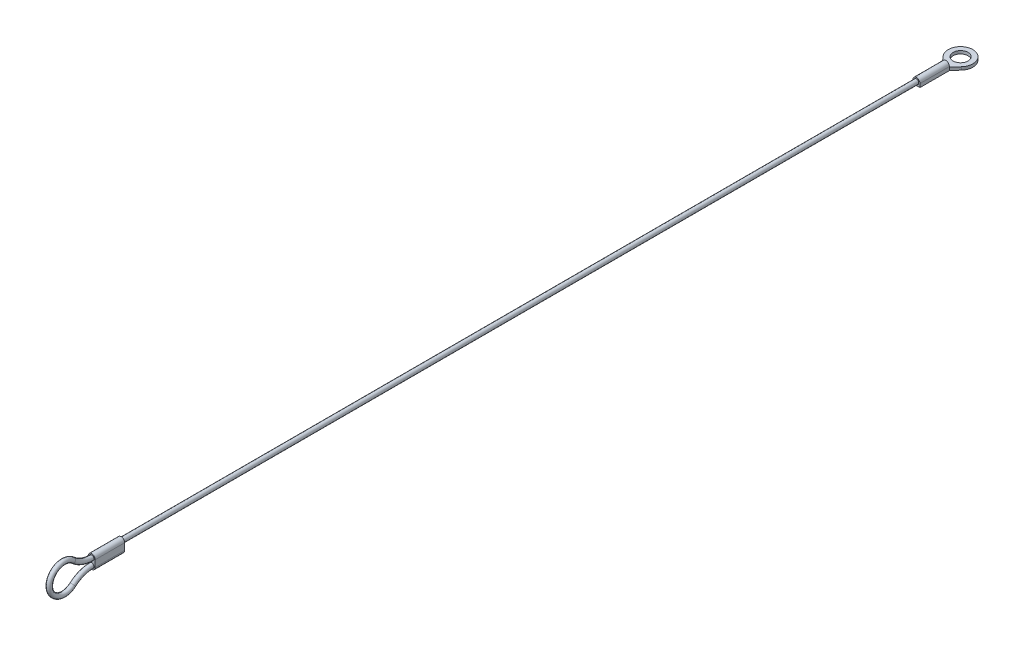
ISO-10303-21;
HEADER;
FILE_DESCRIPTION(('STEP AP214'),'2;1');
FILE_NAME('part.step','',(''),(''),'','','');
FILE_SCHEMA(('AUTOMOTIVE_DESIGN { 1 0 10303 214 1 1 1 1 }'));
ENDSEC;
DATA;
#1=APPLICATION_CONTEXT('core data for automotive mechanical design processes');
#2=APPLICATION_PROTOCOL_DEFINITION('international standard','automotive_design',2000,#1);
#3=PRODUCT_CONTEXT('',#1,'mechanical');
#4=PRODUCT('Part','Part','',(#3));
#5=PRODUCT_RELATED_PRODUCT_CATEGORY('part','',(#4));
#6=PRODUCT_DEFINITION_FORMATION('','',#4);
#7=PRODUCT_DEFINITION_CONTEXT('part definition',#1,'design');
#8=PRODUCT_DEFINITION('design','',#6,#7);
#9=PRODUCT_DEFINITION_SHAPE('','',#8);
#10=(LENGTH_UNIT() NAMED_UNIT(*) SI_UNIT(.MILLI.,.METRE.));
#11=(NAMED_UNIT(*) PLANE_ANGLE_UNIT() SI_UNIT($,.RADIAN.));
#12=(NAMED_UNIT(*) SI_UNIT($,.STERADIAN.) SOLID_ANGLE_UNIT());
#13=UNCERTAINTY_MEASURE_WITH_UNIT(LENGTH_MEASURE(1.E-05),#10,'distance_accuracy_value','');
#14=(GEOMETRIC_REPRESENTATION_CONTEXT(3) GLOBAL_UNCERTAINTY_ASSIGNED_CONTEXT((#13)) GLOBAL_UNIT_ASSIGNED_CONTEXT((#10,
#11,#12)) REPRESENTATION_CONTEXT('',''));
#15=CARTESIAN_POINT('',(0.,0.,0.));
#16=DIRECTION('',(0.,0.,1.));
#17=DIRECTION('',(1.,0.,0.));
#18=AXIS2_PLACEMENT_3D('',#15,#16,#17);
#19=CARTESIAN_POINT('',(0.,0.,-10.));
#20=DIRECTION('',(0.,0.,-1.));
#21=DIRECTION('',(-1.,0.,0.));
#22=AXIS2_PLACEMENT_3D('',#19,#20,#21);
#23=PLANE('',#22);
#24=DIRECTION('',(0.,-1.,0.));
#25=VECTOR('',#24,1.);
#26=CARTESIAN_POINT('',(1.195,0.,-10.));
#27=LINE('',#26,#25);
#28=CARTESIAN_POINT('',(1.195,0.,-10.));
#29=VERTEX_POINT('',#28);
#30=CARTESIAN_POINT('',(1.195,-0.185,-10.));
#31=VERTEX_POINT('',#30);
#32=EDGE_CURVE('E169',#29,#31,#27,.T.);
#33=ORIENTED_EDGE('',*,*,#32,.T.);
#34=DIRECTION('',(-1.,0.,0.));
#35=VECTOR('',#34,1.);
#36=CARTESIAN_POINT('',(-1.195,-0.185,-10.));
#37=LINE('',#36,#35);
#38=CARTESIAN_POINT('',(-1.195,-0.185,-10.));
#39=VERTEX_POINT('',#38);
#40=EDGE_CURVE('E138',#31,#39,#37,.T.);
#41=ORIENTED_EDGE('',*,*,#40,.T.);
#42=DIRECTION('',(0.,1.,0.));
#43=VECTOR('',#42,1.);
#44=CARTESIAN_POINT('',(-1.195,-1.195,-10.));
#45=LINE('',#44,#43);
#46=CARTESIAN_POINT('',(-1.195,0.,-10.));
#47=VERTEX_POINT('',#46);
#48=EDGE_CURVE('E173',#39,#47,#45,.T.);
#49=ORIENTED_EDGE('',*,*,#48,.T.);
#50=CARTESIAN_POINT('',(0.,0.,-10.));
#51=DIRECTION('',(0.,0.,-1.));
#52=DIRECTION('',(-1.,0.,0.));
#53=AXIS2_PLACEMENT_3D('',#50,#51,#52);
#54=CIRCLE('',#53,1.195);
#55=EDGE_CURVE('E166',#47,#29,#54,.T.);
#56=ORIENTED_EDGE('',*,*,#55,.T.);
#57=EDGE_LOOP('',(#33,#41,#49,#56));
#58=FACE_BOUND('',#57,.T.);
#59=ADVANCED_FACE('F33',(#58),#23,.T.);
#60=CARTESIAN_POINT('',(0.,0.,280.2));
#61=DIRECTION('',(0.,0.,-1.));
#62=DIRECTION('',(-1.,0.,0.));
#63=AXIS2_PLACEMENT_3D('',#60,#61,#62);
#64=CYLINDRICAL_SURFACE('',#63,0.795);
#65=CARTESIAN_POINT('',(0.,0.,270.2));
#66=DIRECTION('',(0.,0.,-1.));
#67=DIRECTION('',(0.,1.,0.));
#68=AXIS2_PLACEMENT_3D('',#65,#66,#67);
#69=CIRCLE('',#68,0.795);
#70=CARTESIAN_POINT('',(0.,0.795,270.2));
#71=VERTEX_POINT('',#70);
#72=EDGE_CURVE('E37',#71,#71,#69,.T.);
#73=ORIENTED_EDGE('',*,*,#72,.T.);
#74=EDGE_LOOP('',(#73));
#75=FACE_BOUND('',#74,.T.);
#76=CARTESIAN_POINT('',(0.,0.,0.));
#77=DIRECTION('',(0.,0.,1.));
#78=DIRECTION('',(1.,0.,0.));
#79=AXIS2_PLACEMENT_3D('',#76,#77,#78);
#80=CIRCLE('',#79,0.795);
#81=CARTESIAN_POINT('',(0.795,0.,0.));
#82=VERTEX_POINT('',#81);
#83=EDGE_CURVE('E195',#82,#82,#80,.T.);
#84=ORIENTED_EDGE('',*,*,#83,.T.);
#85=EDGE_LOOP('',(#84));
#86=FACE_BOUND('',#85,.T.);
#87=ADVANCED_FACE('F35',(#75,#86),#64,.T.);
#88=CARTESIAN_POINT('',(0.,3.90601902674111E-13,270.2));
#89=DIRECTION('',(0.,0.,1.));
#90=DIRECTION('',(0.,-1.,0.));
#91=AXIS2_PLACEMENT_3D('',#88,#89,#90);
#92=CYLINDRICAL_SURFACE('',#91,1.195);
#93=CARTESIAN_POINT('',(0.,4.05057931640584E-13,280.2));
#94=DIRECTION('',(0.,0.,-1.));
#95=DIRECTION('',(0.,1.,0.));
#96=AXIS2_PLACEMENT_3D('',#93,#94,#95);
#97=CIRCLE('',#96,1.195);
#98=CARTESIAN_POINT('',(-1.195,4.05204276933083E-13,280.2));
#99=VERTEX_POINT('',#98);
#100=CARTESIAN_POINT('',(1.195,4.04911586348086E-13,280.2));
#101=VERTEX_POINT('',#100);
#102=EDGE_CURVE('E203',#99,#101,#97,.T.);
#103=ORIENTED_EDGE('',*,*,#102,.T.);
#104=DIRECTION('',(0.,0.,1.));
#105=VECTOR('',#104,1.);
#106=CARTESIAN_POINT('',(1.195,3.90455557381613E-13,270.2));
#107=LINE('',#106,#105);
#108=CARTESIAN_POINT('',(1.195,3.90455557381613E-13,270.2));
#109=VERTEX_POINT('',#108);
#110=EDGE_CURVE('E217',#109,#101,#107,.T.);
#111=ORIENTED_EDGE('',*,*,#110,.F.);
#112=CARTESIAN_POINT('',(0.,3.90601902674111E-13,270.2));
#113=DIRECTION('',(0.,0.,-1.));
#114=DIRECTION('',(0.,1.,0.));
#115=AXIS2_PLACEMENT_3D('',#112,#113,#114);
#116=CIRCLE('',#115,1.195);
#117=CARTESIAN_POINT('',(-1.195,3.90748247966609E-13,270.2));
#118=VERTEX_POINT('',#117);
#119=EDGE_CURVE('E196',#118,#109,#116,.T.);
#120=ORIENTED_EDGE('',*,*,#119,.F.);
#121=DIRECTION('',(0.,0.,1.));
#122=VECTOR('',#121,1.);
#123=CARTESIAN_POINT('',(-1.195,3.90748247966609E-13,270.2));
#124=LINE('',#123,#122);
#125=EDGE_CURVE('E202',#118,#99,#124,.T.);
#126=ORIENTED_EDGE('',*,*,#125,.T.);
#127=EDGE_LOOP('',(#103,#111,#120,#126));
#128=FACE_BOUND('',#127,.T.);
#129=ADVANCED_FACE('F258',(#128),#92,.T.);
#130=CARTESIAN_POINT('',(1.195,3.90455557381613E-13,270.2));
#131=DIRECTION('',(-1.,0.,0.));
#132=DIRECTION('',(0.,-1.,0.));
#133=AXIS2_PLACEMENT_3D('',#130,#131,#132);
#134=PLANE('',#133);
#135=DIRECTION('',(0.,-1.,0.));
#136=VECTOR('',#135,1.);
#137=CARTESIAN_POINT('',(1.195,4.04911586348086E-13,280.2));
#138=LINE('',#137,#136);
#139=CARTESIAN_POINT('',(1.195,-2.26625258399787,280.2));
#140=VERTEX_POINT('',#139);
#141=EDGE_CURVE('E206',#101,#140,#138,.T.);
#142=ORIENTED_EDGE('',*,*,#141,.T.);
#143=DIRECTION('',(0.,0.,1.));
#144=VECTOR('',#143,1.);
#145=CARTESIAN_POINT('',(1.195,-2.26625258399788,270.2));
#146=LINE('',#145,#144);
#147=CARTESIAN_POINT('',(1.195,-2.26625258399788,270.2));
#148=VERTEX_POINT('',#147);
#149=EDGE_CURVE('E214',#148,#140,#146,.T.);
#150=ORIENTED_EDGE('',*,*,#149,.F.);
#151=DIRECTION('',(0.,-1.,0.));
#152=VECTOR('',#151,1.);
#153=CARTESIAN_POINT('',(1.195,3.90455557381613E-13,270.2));
#154=LINE('',#153,#152);
#155=EDGE_CURVE('E88',#109,#148,#154,.T.);
#156=ORIENTED_EDGE('',*,*,#155,.F.);
#157=ORIENTED_EDGE('',*,*,#110,.T.);
#158=EDGE_LOOP('',(#142,#150,#156,#157));
#159=FACE_BOUND('',#158,.T.);
#160=ADVANCED_FACE('F287',(#159),#134,.F.);
#161=CARTESIAN_POINT('',(0.,-2.26625258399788,270.2));
#162=DIRECTION('',(0.,0.,1.));
#163=DIRECTION('',(0.,-1.,0.));
#164=AXIS2_PLACEMENT_3D('',#161,#162,#163);
#165=CYLINDRICAL_SURFACE('',#164,1.195);
#166=CARTESIAN_POINT('',(0.,-2.26625258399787,280.2));
#167=DIRECTION('',(0.,0.,-1.));
#168=DIRECTION('',(0.,1.,0.));
#169=AXIS2_PLACEMENT_3D('',#166,#167,#168);
#170=CIRCLE('',#169,1.195);
#171=CARTESIAN_POINT('',(-1.195,-2.26625258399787,280.2));
#172=VERTEX_POINT('',#171);
#173=EDGE_CURVE('E208',#140,#172,#170,.T.);
#174=ORIENTED_EDGE('',*,*,#173,.T.);
#175=DIRECTION('',(0.,0.,1.));
#176=VECTOR('',#175,1.);
#177=CARTESIAN_POINT('',(-1.195,-2.26625258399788,270.2));
#178=LINE('',#177,#176);
#179=CARTESIAN_POINT('',(-1.195,-2.26625258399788,270.2));
#180=VERTEX_POINT('',#179);
#181=EDGE_CURVE('E212',#180,#172,#178,.T.);
#182=ORIENTED_EDGE('',*,*,#181,.F.);
#183=CARTESIAN_POINT('',(0.,-2.26625258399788,270.2));
#184=DIRECTION('',(0.,0.,-1.));
#185=DIRECTION('',(0.,1.,0.));
#186=AXIS2_PLACEMENT_3D('',#183,#184,#185);
#187=CIRCLE('',#186,1.195);
#188=EDGE_CURVE('E199',#148,#180,#187,.T.);
#189=ORIENTED_EDGE('',*,*,#188,.F.);
#190=ORIENTED_EDGE('',*,*,#149,.T.);
#191=EDGE_LOOP('',(#174,#182,#189,#190));
#192=FACE_BOUND('',#191,.T.);
#193=ADVANCED_FACE('F284',(#192),#165,.T.);
#194=CARTESIAN_POINT('',(-1.195,3.90748247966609E-13,270.2));
#195=DIRECTION('',(1.,0.,0.));
#196=DIRECTION('',(0.,0.,-1.));
#197=AXIS2_PLACEMENT_3D('',#194,#195,#196);
#198=PLANE('',#197);
#199=DIRECTION('',(0.,1.,0.));
#200=VECTOR('',#199,1.);
#201=CARTESIAN_POINT('',(-1.195,4.05204276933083E-13,280.2));
#202=LINE('',#201,#200);
#203=EDGE_CURVE('E80',#172,#99,#202,.T.);
#204=ORIENTED_EDGE('',*,*,#203,.T.);
#205=ORIENTED_EDGE('',*,*,#125,.F.);
#206=DIRECTION('',(0.,1.,0.));
#207=VECTOR('',#206,1.);
#208=CARTESIAN_POINT('',(-1.195,3.90748247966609E-13,270.2));
#209=LINE('',#208,#207);
#210=EDGE_CURVE('E59',#180,#118,#209,.T.);
#211=ORIENTED_EDGE('',*,*,#210,.F.);
#212=ORIENTED_EDGE('',*,*,#181,.T.);
#213=EDGE_LOOP('',(#204,#205,#211,#212));
#214=FACE_BOUND('',#213,.T.);
#215=ADVANCED_FACE('F276',(#214),#198,.F.);
#216=CARTESIAN_POINT('',(0.,3.90601902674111E-13,270.2));
#217=DIRECTION('',(0.,0.,-1.));
#218=DIRECTION('',(0.,1.,0.));
#219=AXIS2_PLACEMENT_3D('',#216,#217,#218);
#220=PLANE('',#219);
#221=ORIENTED_EDGE('',*,*,#72,.F.);
#222=EDGE_LOOP('',(#221));
#223=FACE_BOUND('',#222,.T.);
#224=ORIENTED_EDGE('',*,*,#119,.T.);
#225=ORIENTED_EDGE('',*,*,#155,.T.);
#226=ORIENTED_EDGE('',*,*,#188,.T.);
#227=ORIENTED_EDGE('',*,*,#210,.T.);
#228=EDGE_LOOP('',(#224,#225,#226,#227));
#229=FACE_BOUND('',#228,.T.);
#230=ADVANCED_FACE('F272',(#223,#229),#220,.T.);
#231=CARTESIAN_POINT('',(0.,4.05057931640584E-13,280.2));
#232=DIRECTION('',(0.,0.,-1.));
#233=DIRECTION('',(0.,1.,0.));
#234=AXIS2_PLACEMENT_3D('',#231,#232,#233);
#235=PLANE('',#234);
#236=CARTESIAN_POINT('',(0.,-2.26625258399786,280.2));
#237=DIRECTION('',(0.,0.,-1.));
#238=DIRECTION('',(1.,0.,0.));
#239=AXIS2_PLACEMENT_3D('',#236,#237,#238);
#240=CIRCLE('',#239,0.795);
#241=CARTESIAN_POINT('',(0.,-1.47125258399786,280.2));
#242=VERTEX_POINT('',#241);
#243=EDGE_CURVE('E222',#242,#242,#240,.T.);
#244=ORIENTED_EDGE('',*,*,#243,.T.);
#245=EDGE_LOOP('',(#244));
#246=FACE_BOUND('',#245,.T.);
#247=CARTESIAN_POINT('',(0.,0.,280.2));
#248=DIRECTION('',(0.,0.,-1.));
#249=DIRECTION('',(0.,1.,0.));
#250=AXIS2_PLACEMENT_3D('',#247,#248,#249);
#251=CIRCLE('',#250,0.795);
#252=CARTESIAN_POINT('',(0.,-0.795000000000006,280.2));
#253=VERTEX_POINT('',#252);
#254=EDGE_CURVE('E219',#253,#253,#251,.T.);
#255=ORIENTED_EDGE('',*,*,#254,.T.);
#256=EDGE_LOOP('',(#255));
#257=FACE_BOUND('',#256,.T.);
#258=ORIENTED_EDGE('',*,*,#102,.F.);
#259=ORIENTED_EDGE('',*,*,#203,.F.);
#260=ORIENTED_EDGE('',*,*,#173,.F.);
#261=ORIENTED_EDGE('',*,*,#141,.F.);
#262=EDGE_LOOP('',(#258,#259,#260,#261));
#263=FACE_BOUND('',#262,.T.);
#264=ADVANCED_FACE('F275',(#246,#257,#263),#235,.F.);
#265=CARTESIAN_POINT('',(0.,-11.8662525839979,280.2));
#266=DIRECTION('',(1.,0.,0.));
#267=DIRECTION('',(0.,0.,-1.));
#268=AXIS2_PLACEMENT_3D('',#265,#266,#267);
#269=TOROIDAL_SURFACE('',#268,9.6,0.795);
#270=CARTESIAN_POINT('',(0.,-4.7108350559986,286.6));
#271=DIRECTION('',(0.,0.666666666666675,-0.745355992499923));
#272=DIRECTION('',(1.,0.,0.));
#273=AXIS2_PLACEMENT_3D('',#270,#271,#272);
#274=CIRCLE('',#273,0.795);
#275=CARTESIAN_POINT('',(0.,-4.11827704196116,287.13));
#276=VERTEX_POINT('',#275);
#277=EDGE_CURVE('E42',#276,#276,#274,.T.);
#278=CARTESIAN_POINT('',(0.,-11.8662525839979,280.2));
#279=DIRECTION('',(1.,0.,0.));
#280=DIRECTION('',(0.,0.,-1.));
#281=AXIS2_PLACEMENT_3D('',#278,#279,#280);
#282=CIRCLE('',#281,10.395);
#283=EDGE_CURVE('',#242,#276,#282,.T.);
#284=ORIENTED_EDGE('',*,*,#243,.F.);
#285=ORIENTED_EDGE('',*,*,#277,.T.);
#286=ORIENTED_EDGE('',*,*,#283,.T.);
#287=ORIENTED_EDGE('',*,*,#283,.F.);
#288=EDGE_LOOP('',(#284,#286,#285,#287));
#289=FACE_BOUND('',#288,.T.);
#290=ADVANCED_FACE('F280',(#289),#269,.T.);
#291=CARTESIAN_POINT('',(0.,-1.13312629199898,289.8));
#292=DIRECTION('',(-1.,0.,0.));
#293=DIRECTION('',(0.,0.,1.));
#294=AXIS2_PLACEMENT_3D('',#291,#292,#293);
#295=TOROIDAL_SURFACE('',#294,4.79999999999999,0.795);
#296=CARTESIAN_POINT('',(0.,2.44458247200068,286.6));
#297=DIRECTION('',(0.,0.666666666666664,0.745355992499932));
#298=DIRECTION('',(1.,0.,0.));
#299=AXIS2_PLACEMENT_3D('',#296,#297,#298);
#300=CIRCLE('',#299,0.795);
#301=CARTESIAN_POINT('',(0.,1.85202445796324,287.13));
#302=VERTEX_POINT('',#301);
#303=EDGE_CURVE('E11',#302,#302,#300,.T.);
#304=ORIENTED_EDGE('',*,*,#303,.T.);
#305=EDGE_LOOP('',(#304));
#306=FACE_BOUND('',#305,.T.);
#307=ORIENTED_EDGE('',*,*,#277,.F.);
#308=EDGE_LOOP('',(#307));
#309=FACE_BOUND('',#308,.T.);
#310=ADVANCED_FACE('F296',(#306,#309),#295,.T.);
#311=CARTESIAN_POINT('',(0.,9.6,280.2));
#312=DIRECTION('',(1.,0.,0.));
#313=DIRECTION('',(0.,0.,-1.));
#314=AXIS2_PLACEMENT_3D('',#311,#312,#313);
#315=TOROIDAL_SURFACE('',#314,9.6,0.795);
#316=CARTESIAN_POINT('',(0.,9.6,280.2));
#317=DIRECTION('',(1.,0.,0.));
#318=DIRECTION('',(0.,0.,-1.));
#319=AXIS2_PLACEMENT_3D('',#316,#317,#318);
#320=CIRCLE('',#319,10.395);
#321=EDGE_CURVE('',#302,#253,#320,.T.);
#322=ORIENTED_EDGE('',*,*,#303,.F.);
#323=ORIENTED_EDGE('',*,*,#254,.F.);
#324=ORIENTED_EDGE('',*,*,#321,.T.);
#325=ORIENTED_EDGE('',*,*,#321,.F.);
#326=EDGE_LOOP('',(#322,#324,#323,#325));
#327=FACE_BOUND('',#326,.T.);
#328=ADVANCED_FACE('F271',(#327),#315,.T.);
#329=CARTESIAN_POINT('',(0.,0.,-10.));
#330=DIRECTION('',(0.,0.,1.));
#331=DIRECTION('',(1.,0.,0.));
#332=AXIS2_PLACEMENT_3D('',#329,#330,#331);
#333=CYLINDRICAL_SURFACE('',#332,1.195);
#334=CARTESIAN_POINT('',(0.,0.,0.));
#335=DIRECTION('',(0.,0.,-1.));
#336=DIRECTION('',(-1.,0.,0.));
#337=AXIS2_PLACEMENT_3D('',#334,#335,#336);
#338=CIRCLE('',#337,1.195);
#339=CARTESIAN_POINT('',(-1.195,0.,0.));
#340=VERTEX_POINT('',#339);
#341=CARTESIAN_POINT('',(1.195,0.,0.));
#342=VERTEX_POINT('',#341);
#343=EDGE_CURVE('E164',#340,#342,#338,.T.);
#344=ORIENTED_EDGE('',*,*,#343,.T.);
#345=DIRECTION('',(0.,0.,1.));
#346=VECTOR('',#345,1.);
#347=CARTESIAN_POINT('',(1.195,0.,-10.));
#348=LINE('',#347,#346);
#349=EDGE_CURVE('E192',#29,#342,#348,.T.);
#350=ORIENTED_EDGE('',*,*,#349,.F.);
#351=ORIENTED_EDGE('',*,*,#55,.F.);
#352=DIRECTION('',(0.,0.,1.));
#353=VECTOR('',#352,1.);
#354=CARTESIAN_POINT('',(-1.195,0.,-10.));
#355=LINE('',#354,#353);
#356=EDGE_CURVE('E175',#47,#340,#355,.T.);
#357=ORIENTED_EDGE('',*,*,#356,.T.);
#358=EDGE_LOOP('',(#344,#350,#351,#357));
#359=FACE_BOUND('',#358,.T.);
#360=ADVANCED_FACE('F239',(#359),#333,.T.);
#361=CARTESIAN_POINT('',(1.195,0.,-10.));
#362=DIRECTION('',(-1.,0.,0.));
#363=DIRECTION('',(0.,-1.,0.));
#364=AXIS2_PLACEMENT_3D('',#361,#362,#363);
#365=PLANE('',#364);
#366=DIRECTION('',(0.,-1.,0.));
#367=VECTOR('',#366,1.);
#368=CARTESIAN_POINT('',(1.195,0.,0.));
#369=LINE('',#368,#367);
#370=CARTESIAN_POINT('',(1.195,-1.195,0.));
#371=VERTEX_POINT('',#370);
#372=EDGE_CURVE('E178',#342,#371,#369,.T.);
#373=ORIENTED_EDGE('',*,*,#372,.T.);
#374=DIRECTION('',(0.,0.,1.));
#375=VECTOR('',#374,1.);
#376=CARTESIAN_POINT('',(1.195,-1.195,-10.));
#377=LINE('',#376,#375);
#378=CARTESIAN_POINT('',(1.195,-1.195,-10.));
#379=VERTEX_POINT('',#378);
#380=EDGE_CURVE('E189',#379,#371,#377,.T.);
#381=ORIENTED_EDGE('',*,*,#380,.F.);
#382=DIRECTION('',(0.,-1.,0.));
#383=VECTOR('',#382,1.);
#384=CARTESIAN_POINT('',(1.195,-0.185,-10.));
#385=LINE('',#384,#383);
#386=EDGE_CURVE('E162',#31,#379,#385,.T.);
#387=ORIENTED_EDGE('',*,*,#386,.F.);
#388=ORIENTED_EDGE('',*,*,#32,.F.);
#389=ORIENTED_EDGE('',*,*,#349,.T.);
#390=EDGE_LOOP('',(#373,#381,#387,#388,#389));
#391=FACE_BOUND('',#390,.T.);
#392=ADVANCED_FACE('F250',(#391),#365,.F.);
#393=CARTESIAN_POINT('',(0.,-1.195,-10.));
#394=DIRECTION('',(0.,1.,0.));
#395=DIRECTION('',(0.,0.,1.));
#396=AXIS2_PLACEMENT_3D('',#393,#394,#395);
#397=PLANE('',#396);
#398=DIRECTION('',(-1.,0.,0.));
#399=VECTOR('',#398,1.);
#400=CARTESIAN_POINT('',(0.,-1.195,0.));
#401=LINE('',#400,#399);
#402=CARTESIAN_POINT('',(-1.195,-1.195,0.));
#403=VERTEX_POINT('',#402);
#404=EDGE_CURVE('E181',#371,#403,#401,.T.);
#405=ORIENTED_EDGE('',*,*,#404,.T.);
#406=DIRECTION('',(0.,0.,1.));
#407=VECTOR('',#406,1.);
#408=CARTESIAN_POINT('',(-1.195,-1.195,-10.));
#409=LINE('',#408,#407);
#410=CARTESIAN_POINT('',(-1.195,-1.195,-10.));
#411=VERTEX_POINT('',#410);
#412=EDGE_CURVE('E186',#411,#403,#409,.T.);
#413=ORIENTED_EDGE('',*,*,#412,.F.);
#414=DIRECTION('',(-0.658036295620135,0.,-0.752986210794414));
#415=VECTOR('',#414,1.);
#416=CARTESIAN_POINT('',(-3.15501222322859,-1.195,-12.2428279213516));
#417=LINE('',#416,#415);
#418=CARTESIAN_POINT('',(-3.1550122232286,-1.195,-12.2428279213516));
#419=VERTEX_POINT('',#418);
#420=EDGE_CURVE('E158',#411,#419,#417,.T.);
#421=ORIENTED_EDGE('',*,*,#420,.T.);
#422=CARTESIAN_POINT('',(0.,-1.195,-15.));
#423=DIRECTION('',(0.,-1.,0.));
#424=DIRECTION('',(0.,0.,1.));
#425=AXIS2_PLACEMENT_3D('',#422,#423,#424);
#426=CIRCLE('',#425,4.19);
#427=CARTESIAN_POINT('',(3.15501222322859,-1.195,-12.2428279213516));
#428=VERTEX_POINT('',#427);
#429=EDGE_CURVE('E134',#419,#428,#426,.T.);
#430=ORIENTED_EDGE('',*,*,#429,.T.);
#431=DIRECTION('',(-0.658036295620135,0.,0.752986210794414));
#432=VECTOR('',#431,1.);
#433=CARTESIAN_POINT('',(1.195,-1.195,-10.));
#434=LINE('',#433,#432);
#435=EDGE_CURVE('E148',#428,#379,#434,.T.);
#436=ORIENTED_EDGE('',*,*,#435,.T.);
#437=ORIENTED_EDGE('',*,*,#380,.T.);
#438=EDGE_LOOP('',(#405,#413,#421,#430,#436,#437));
#439=FACE_BOUND('',#438,.T.);
#440=CARTESIAN_POINT('',(0.,-1.195,-15.));
#441=DIRECTION('',(0.,-1.,0.));
#442=DIRECTION('',(0.,0.,-1.));
#443=AXIS2_PLACEMENT_3D('',#440,#441,#442);
#444=CIRCLE('',#443,2.54);
#445=CARTESIAN_POINT('',(0.,-1.195,-17.54));
#446=VERTEX_POINT('',#445);
#447=EDGE_CURVE('E153',#446,#446,#444,.T.);
#448=ORIENTED_EDGE('',*,*,#447,.F.);
#449=EDGE_LOOP('',(#448));
#450=FACE_BOUND('',#449,.T.);
#451=ADVANCED_FACE('F246',(#439,#450),#397,.F.);
#452=CARTESIAN_POINT('',(-1.195,-1.195,-10.));
#453=DIRECTION('',(1.,0.,0.));
#454=DIRECTION('',(0.,1.,0.));
#455=AXIS2_PLACEMENT_3D('',#452,#453,#454);
#456=PLANE('',#455);
#457=DIRECTION('',(0.,1.,0.));
#458=VECTOR('',#457,1.);
#459=CARTESIAN_POINT('',(-1.195,-1.195,0.));
#460=LINE('',#459,#458);
#461=EDGE_CURVE('E170',#403,#340,#460,.T.);
#462=ORIENTED_EDGE('',*,*,#461,.T.);
#463=ORIENTED_EDGE('',*,*,#356,.F.);
#464=ORIENTED_EDGE('',*,*,#48,.F.);
#465=EDGE_CURVE('E146',#411,#39,#45,.T.);
#466=ORIENTED_EDGE('',*,*,#465,.F.);
#467=ORIENTED_EDGE('',*,*,#412,.T.);
#468=EDGE_LOOP('',(#462,#463,#464,#466,#467));
#469=FACE_BOUND('',#468,.T.);
#470=ADVANCED_FACE('F233',(#469),#456,.F.);
#471=CARTESIAN_POINT('',(0.,0.,0.));
#472=DIRECTION('',(0.,0.,-1.));
#473=DIRECTION('',(-1.,0.,0.));
#474=AXIS2_PLACEMENT_3D('',#471,#472,#473);
#475=PLANE('',#474);
#476=ORIENTED_EDGE('',*,*,#83,.F.);
#477=EDGE_LOOP('',(#476));
#478=FACE_BOUND('',#477,.T.);
#479=ORIENTED_EDGE('',*,*,#343,.F.);
#480=ORIENTED_EDGE('',*,*,#461,.F.);
#481=ORIENTED_EDGE('',*,*,#404,.F.);
#482=ORIENTED_EDGE('',*,*,#372,.F.);
#483=EDGE_LOOP('',(#479,#480,#481,#482));
#484=FACE_BOUND('',#483,.T.);
#485=ADVANCED_FACE('F230',(#478,#484),#475,.F.);
#486=CARTESIAN_POINT('',(-3.15501222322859,-0.185,-12.2428279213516));
#487=DIRECTION('',(-0.752986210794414,0.,0.658036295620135));
#488=DIRECTION('',(0.658036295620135,0.,0.752986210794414));
#489=AXIS2_PLACEMENT_3D('',#486,#487,#488);
#490=PLANE('',#489);
#491=ORIENTED_EDGE('',*,*,#420,.F.);
#492=ORIENTED_EDGE('',*,*,#465,.T.);
#493=DIRECTION('',(-0.658036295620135,0.,-0.752986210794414));
#494=VECTOR('',#493,1.);
#495=CARTESIAN_POINT('',(-3.15501222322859,-0.185,-12.2428279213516));
#496=LINE('',#495,#494);
#497=CARTESIAN_POINT('',(-3.1550122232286,-0.185,-12.2428279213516));
#498=VERTEX_POINT('',#497);
#499=EDGE_CURVE('E50',#39,#498,#496,.T.);
#500=ORIENTED_EDGE('',*,*,#499,.T.);
#501=DIRECTION('',(0.,-1.,0.));
#502=VECTOR('',#501,1.);
#503=CARTESIAN_POINT('',(-3.1550122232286,-0.185,-12.2428279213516));
#504=LINE('',#503,#502);
#505=EDGE_CURVE('E130',#498,#419,#504,.T.);
#506=ORIENTED_EDGE('',*,*,#505,.T.);
#507=EDGE_LOOP('',(#491,#492,#500,#506));
#508=FACE_BOUND('',#507,.T.);
#509=ADVANCED_FACE('F144',(#508),#490,.T.);
#510=CARTESIAN_POINT('',(1.195,-0.185,-10.));
#511=DIRECTION('',(0.752986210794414,0.,0.658036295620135));
#512=DIRECTION('',(0.658036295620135,0.,-0.752986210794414));
#513=AXIS2_PLACEMENT_3D('',#510,#511,#512);
#514=PLANE('',#513);
#515=ORIENTED_EDGE('',*,*,#435,.F.);
#516=DIRECTION('',(0.,-1.,0.));
#517=VECTOR('',#516,1.);
#518=CARTESIAN_POINT('',(3.15501222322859,-0.185,-12.2428279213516));
#519=LINE('',#518,#517);
#520=CARTESIAN_POINT('',(3.15501222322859,-0.185,-12.2428279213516));
#521=VERTEX_POINT('',#520);
#522=EDGE_CURVE('E137',#521,#428,#519,.T.);
#523=ORIENTED_EDGE('',*,*,#522,.F.);
#524=DIRECTION('',(-0.658036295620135,0.,0.752986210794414));
#525=VECTOR('',#524,1.);
#526=CARTESIAN_POINT('',(1.195,-0.185,-10.));
#527=LINE('',#526,#525);
#528=EDGE_CURVE('E142',#521,#31,#527,.T.);
#529=ORIENTED_EDGE('',*,*,#528,.T.);
#530=ORIENTED_EDGE('',*,*,#386,.T.);
#531=EDGE_LOOP('',(#515,#523,#529,#530));
#532=FACE_BOUND('',#531,.T.);
#533=ADVANCED_FACE('F349',(#532),#514,.T.);
#534=CARTESIAN_POINT('',(0.,-0.185,-15.));
#535=DIRECTION('',(0.,-1.,0.));
#536=DIRECTION('',(0.,0.,-1.));
#537=AXIS2_PLACEMENT_3D('',#534,#535,#536);
#538=CYLINDRICAL_SURFACE('',#537,4.19);
#539=ORIENTED_EDGE('',*,*,#429,.F.);
#540=ORIENTED_EDGE('',*,*,#505,.F.);
#541=CARTESIAN_POINT('',(0.,-0.185,-15.));
#542=DIRECTION('',(0.,-1.,0.));
#543=DIRECTION('',(0.,0.,1.));
#544=AXIS2_PLACEMENT_3D('',#541,#542,#543);
#545=CIRCLE('',#544,4.19);
#546=EDGE_CURVE('E132',#498,#521,#545,.T.);
#547=ORIENTED_EDGE('',*,*,#546,.T.);
#548=ORIENTED_EDGE('',*,*,#522,.T.);
#549=EDGE_LOOP('',(#539,#540,#547,#548));
#550=FACE_BOUND('',#549,.T.);
#551=ADVANCED_FACE('F131',(#550),#538,.T.);
#552=CARTESIAN_POINT('',(0.,-0.185,-15.));
#553=DIRECTION('',(0.,1.,0.));
#554=DIRECTION('',(0.,0.,1.));
#555=AXIS2_PLACEMENT_3D('',#552,#553,#554);
#556=PLANE('',#555);
#557=CARTESIAN_POINT('',(0.,-0.185,-15.));
#558=DIRECTION('',(0.,-1.,0.));
#559=DIRECTION('',(0.,0.,-1.));
#560=AXIS2_PLACEMENT_3D('',#557,#558,#559);
#561=CIRCLE('',#560,2.54);
#562=CARTESIAN_POINT('',(0.,-0.185,-17.54));
#563=VERTEX_POINT('',#562);
#564=EDGE_CURVE('E160',#563,#563,#561,.T.);
#565=ORIENTED_EDGE('',*,*,#564,.T.);
#566=EDGE_LOOP('',(#565));
#567=FACE_BOUND('',#566,.T.);
#568=ORIENTED_EDGE('',*,*,#499,.F.);
#569=ORIENTED_EDGE('',*,*,#40,.F.);
#570=ORIENTED_EDGE('',*,*,#528,.F.);
#571=ORIENTED_EDGE('',*,*,#546,.F.);
#572=EDGE_LOOP('',(#568,#569,#570,#571));
#573=FACE_BOUND('',#572,.T.);
#574=ADVANCED_FACE('F141',(#567,#573),#556,.T.);
#575=CARTESIAN_POINT('',(0.,-0.185,-15.));
#576=DIRECTION('',(0.,-1.,0.));
#577=DIRECTION('',(0.,0.,-1.));
#578=AXIS2_PLACEMENT_3D('',#575,#576,#577);
#579=CYLINDRICAL_SURFACE('',#578,2.54);
#580=ORIENTED_EDGE('',*,*,#564,.F.);
#581=EDGE_LOOP('',(#580));
#582=FACE_BOUND('',#581,.T.);
#583=ORIENTED_EDGE('',*,*,#447,.T.);
#584=EDGE_LOOP('',(#583));
#585=FACE_BOUND('',#584,.T.);
#586=ADVANCED_FACE('F367',(#582,#585),#579,.F.);
#587=CLOSED_SHELL('',(#59,#87,#129,#160,#193,#215,#230,#264,#290,#310,#328,#360,#392,#451,#470,
#485,#509,#533,#551,#574,#586));
#588=MANIFOLD_SOLID_BREP('B2',#587);
#589=ADVANCED_BREP_SHAPE_REPRESENTATION('',(#18,#588),#14);
#590=SHAPE_DEFINITION_REPRESENTATION(#9,#589);
ENDSEC;
END-ISO-10303-21;
